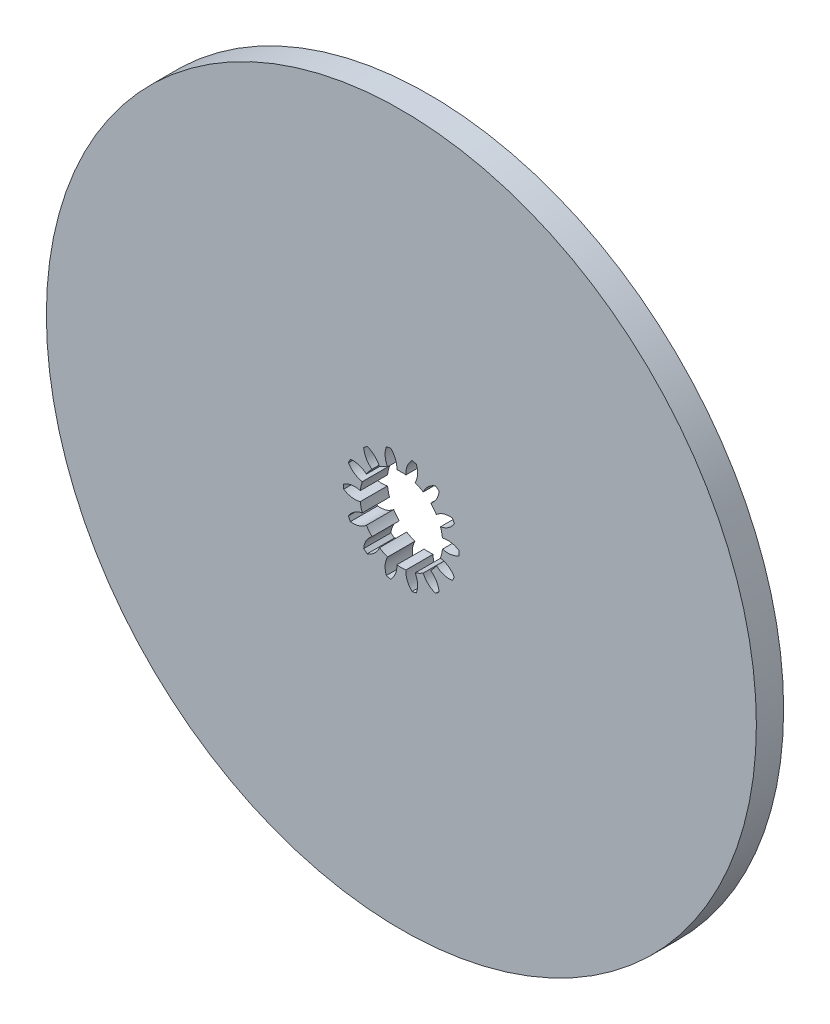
from build123d import *

# Parameters (mm, degrees)
SKETCH1_R           = 39.06
BOSS_EXTRUDE1_DEPTH = 3


with BuildPart() as part:
    # Sketch1 → Boss-Extrude1 (new body)
    with BuildSketch(Plane.XY):
        Circle(SKETCH1_R)
        with BuildLine():
            ThreePointArc((3.848044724, -2.43349656), (4.670022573, -2.895754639), (5.609682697, -2.975560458))
            ThreePointArc((5.609682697, -2.975560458), (5.721152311, -2.755161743), (5.823966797, -2.530594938))
            ThreePointArc((5.823966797, -2.530594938), (5.175703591, -1.845697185), (4.301800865, -1.491262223))
            ThreePointArc((4.301800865, -1.491262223), (4.438798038, -1.013126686), (4.522823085, -0.522900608))
            ThreePointArc((4.522823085, -0.522900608), (5.463965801, -0.582737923), (6.345196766, -0.246937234))
            ThreePointArc((6.345196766, -0.246937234), (6.35, 0), (6.345196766, 0.246937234))
            ThreePointArc((6.345196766, 0.246937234), (5.463965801, 0.582737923), (4.522823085, 0.522900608))
            ThreePointArc((4.522823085, 0.522900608), (4.438798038, 1.013126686), (4.301800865, 1.491262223))
            ThreePointArc((4.301800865, 1.491262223), (5.175703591, 1.845697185), (5.823966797, 2.530594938))
            ThreePointArc((5.823966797, 2.530594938), (5.721152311, 2.755161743), (5.609682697, 2.975560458))
            ThreePointArc((5.609682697, 2.975560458), (4.670022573, 2.895754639), (3.848044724, 2.43349656))
            ThreePointArc((3.848044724, 2.43349656), (3.559639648, 2.838717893), (3.228754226, 3.210062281))
            ThreePointArc((3.228754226, 3.210062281), (3.862329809, 3.90856933), (4.149228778, 4.806911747))
            ThreePointArc((4.149228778, 4.806911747), (3.959160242, 4.964629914), (3.763102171, 5.114837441))
            ThreePointArc((3.763102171, 5.114837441), (2.9511241, 4.635231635), (2.411113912, 3.862108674))
            ThreePointArc((2.411113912, 3.862108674), (1.97545097, 4.102066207), (1.516213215, 4.293070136))
            ThreePointArc((1.516213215, 4.293070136), (1.78397424, 5.197301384), (1.652685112, 6.131160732))
            ThreePointArc((1.652685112, 6.131160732), (1.413007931, 6.190792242), (1.171193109, 6.24105814))
            ThreePointArc((1.171193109, 6.24105814), (0.647719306, 5.456644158), (0.496632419, 4.525782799))
            ThreePointArc((0.496632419, 4.525782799), (0, 4.55295), (-0.496632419, 4.525782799))
            ThreePointArc((-0.496632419, 4.525782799), (-0.647719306, 5.456644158), (-1.171193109, 6.24105814))
            ThreePointArc((-1.171193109, 6.24105814), (-1.413007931, 6.190792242), (-1.652685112, 6.131160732))
            ThreePointArc((-1.652685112, 6.131160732), (-1.78397424, 5.197301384), (-1.516213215, 4.293070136))
            ThreePointArc((-1.516213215, 4.293070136), (-1.97545097, 4.102066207), (-2.411113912, 3.862108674))
            ThreePointArc((-2.411113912, 3.862108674), (-2.9511241, 4.635231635), (-3.763102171, 5.114837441))
            ThreePointArc((-3.763102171, 5.114837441), (-3.959160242, 4.964629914), (-4.149228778, 4.806911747))
            ThreePointArc((-4.149228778, 4.806911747), (-3.862329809, 3.90856933), (-3.228754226, 3.210062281))
            ThreePointArc((-3.228754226, 3.210062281), (-3.559639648, 2.838717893), (-3.848044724, 2.43349656))
            ThreePointArc((-3.848044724, 2.43349656), (-4.670022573, 2.895754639), (-5.609682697, 2.975560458))
            ThreePointArc((-5.609682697, 2.975560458), (-5.721152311, 2.755161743), (-5.823966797, 2.530594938))
            ThreePointArc((-5.823966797, 2.530594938), (-5.175703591, 1.845697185), (-4.301800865, 1.491262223))
            ThreePointArc((-4.301800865, 1.491262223), (-4.438798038, 1.013126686), (-4.522823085, 0.522900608))
            ThreePointArc((-4.522823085, 0.522900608), (-5.463965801, 0.582737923), (-6.345196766, 0.246937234))
            ThreePointArc((-6.345196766, 0.246937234), (-6.35, 0), (-6.345196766, -0.246937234))
            ThreePointArc((-6.345196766, -0.246937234), (-5.463965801, -0.582737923), (-4.522823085, -0.522900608))
            ThreePointArc((-4.522823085, -0.522900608), (-4.438798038, -1.013126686), (-4.301800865, -1.491262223))
            ThreePointArc((-4.301800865, -1.491262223), (-5.175703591, -1.845697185), (-5.823966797, -2.530594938))
            ThreePointArc((-5.823966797, -2.530594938), (-5.721152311, -2.755161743), (-5.609682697, -2.975560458))
            ThreePointArc((-5.609682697, -2.975560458), (-4.670022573, -2.895754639), (-3.848044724, -2.43349656))
            ThreePointArc((-3.848044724, -2.43349656), (-3.559639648, -2.838717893), (-3.228754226, -3.210062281))
            ThreePointArc((-3.228754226, -3.210062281), (-3.862329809, -3.90856933), (-4.149228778, -4.806911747))
            ThreePointArc((-4.149228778, -4.806911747), (-3.959160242, -4.964629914), (-3.763102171, -5.114837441))
            ThreePointArc((-3.763102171, -5.114837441), (-2.9511241, -4.635231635), (-2.411113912, -3.862108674))
            ThreePointArc((-2.411113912, -3.862108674), (-1.97545097, -4.102066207), (-1.516213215, -4.293070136))
            ThreePointArc((-1.516213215, -4.293070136), (-1.78397424, -5.197301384), (-1.652685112, -6.131160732))
            ThreePointArc((-1.652685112, -6.131160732), (-1.413007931, -6.190792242), (-1.171193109, -6.24105814))
            ThreePointArc((-1.171193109, -6.24105814), (-0.647719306, -5.456644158), (-0.496632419, -4.525782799))
            ThreePointArc((-0.496632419, -4.525782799), (0, -4.55295), (0.496632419, -4.525782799))
            ThreePointArc((0.496632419, -4.525782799), (0.647719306, -5.456644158), (1.171193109, -6.24105814))
            ThreePointArc((1.171193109, -6.24105814), (1.413007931, -6.190792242), (1.652685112, -6.131160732))
            ThreePointArc((1.652685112, -6.131160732), (1.78397424, -5.197301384), (1.516213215, -4.293070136))
            ThreePointArc((1.516213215, -4.293070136), (1.97545097, -4.102066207), (2.411113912, -3.862108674))
            ThreePointArc((2.411113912, -3.862108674), (2.9511241, -4.635231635), (3.763102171, -5.114837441))
            ThreePointArc((3.763102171, -5.114837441), (3.959160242, -4.964629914), (4.149228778, -4.806911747))
            ThreePointArc((4.149228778, -4.806911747), (3.862329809, -3.90856933), (3.228754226, -3.210062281))
            ThreePointArc((3.228754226, -3.210062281), (3.559639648, -2.838717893), (3.848044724, -2.43349656))
        make_face(mode=Mode.SUBTRACT)
    extrude(amount=-BOSS_EXTRUDE1_DEPTH)


solid = part.part
